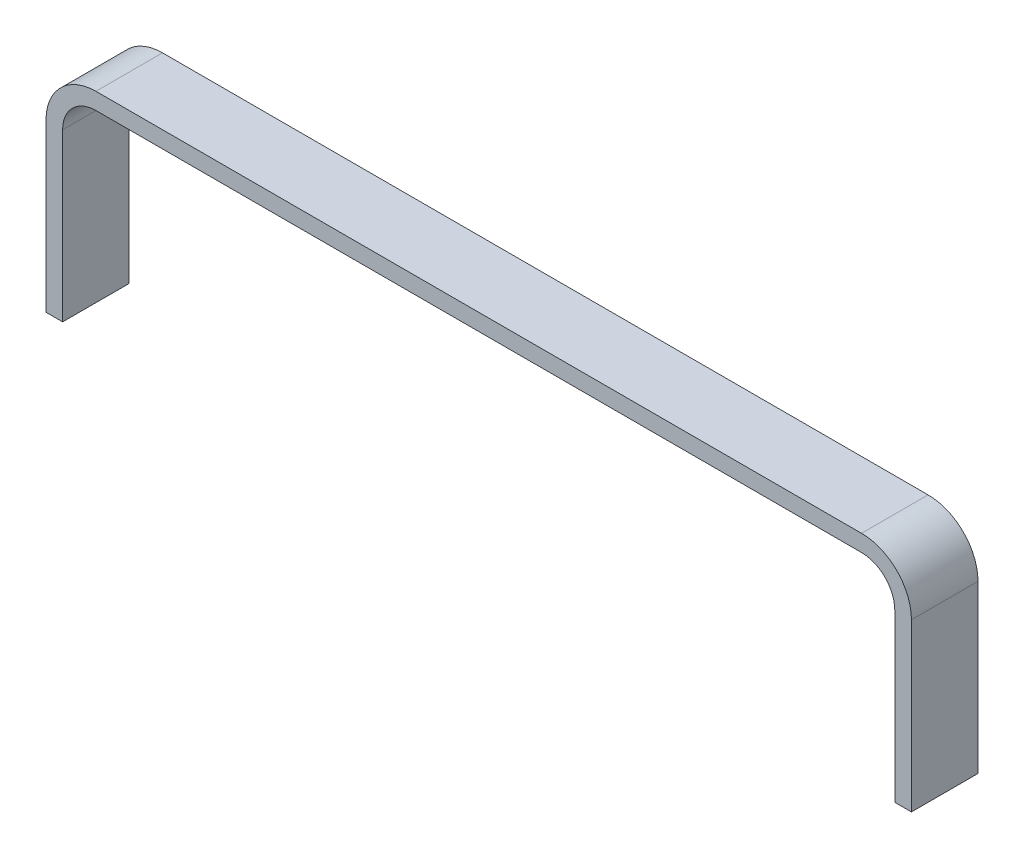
from build123d import *

# Parameters (mm, degrees)
EXTRUSION1_DEPTH = 20


with BuildPart() as part:
    # Esquisse1 → Extrusion1 (new body)
    with BuildSketch(Plane.XY):
        with BuildLine():
            Line((0, 0), (5, 0))
            Line((5, 0), (5, 50))
            ThreePointArc((5, 50), (7.928932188, 57.071067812), (15, 60))
            Line((15, 60), (245, 60))
            ThreePointArc((245, 60), (252.071067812, 57.071067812), (255, 50))
            Line((255, 50), (255, 0))
            Line((255, 0), (260, 0))
            Line((260, 0), (260, 50))
            ThreePointArc((260, 50), (255.606601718, 60.606601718), (245, 65))
            Line((245, 65), (15, 65))
            ThreePointArc((15, 65), (4.393398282, 60.606601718), (0, 50))
            Line((0, 50), (0, 0))
        make_face()
    extrude(amount=EXTRUSION1_DEPTH)


solid = part.part
